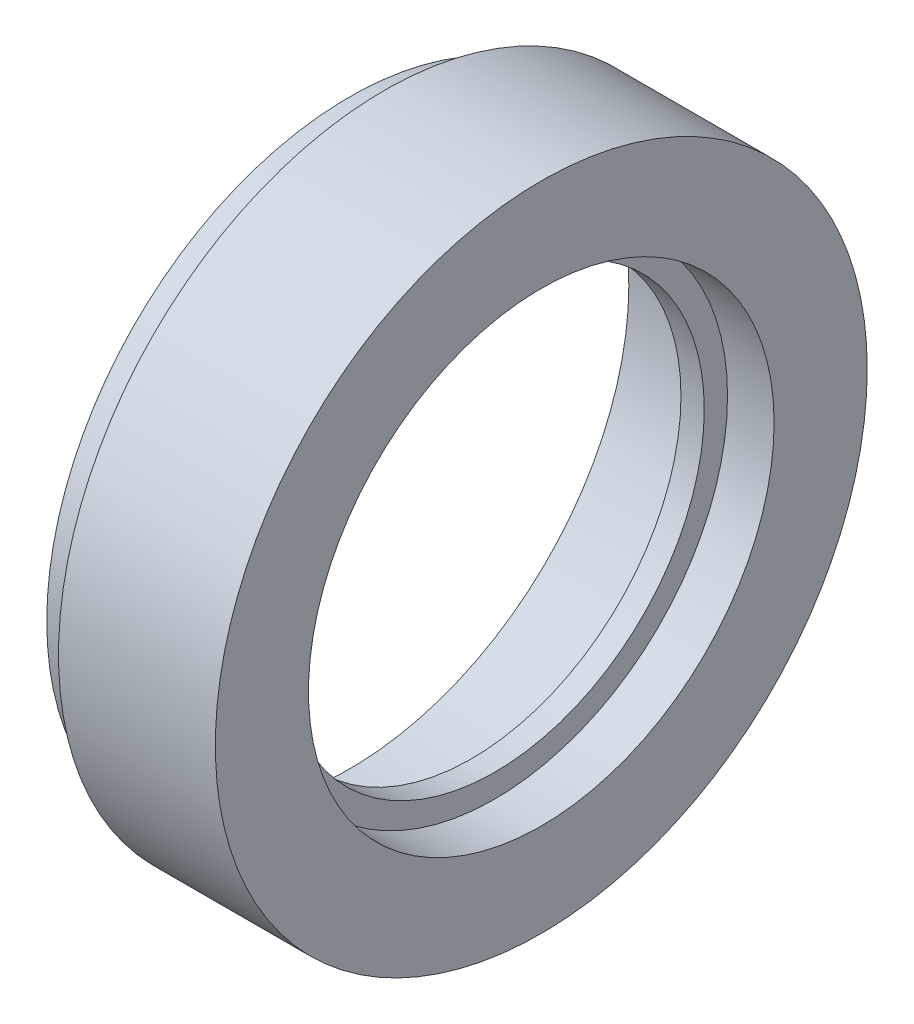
ISO-10303-21;
HEADER;
FILE_DESCRIPTION(('STEP AP214'),'2;1');
FILE_NAME('part.step','',(''),(''),'','','');
FILE_SCHEMA(('AUTOMOTIVE_DESIGN { 1 0 10303 214 1 1 1 1 }'));
ENDSEC;
DATA;
#1=APPLICATION_CONTEXT('core data for automotive mechanical design processes');
#2=APPLICATION_PROTOCOL_DEFINITION('international standard','automotive_design',2000,#1);
#3=PRODUCT_CONTEXT('',#1,'mechanical');
#4=PRODUCT('Part','Part','',(#3));
#5=PRODUCT_RELATED_PRODUCT_CATEGORY('part','',(#4));
#6=PRODUCT_DEFINITION_FORMATION('','',#4);
#7=PRODUCT_DEFINITION_CONTEXT('part definition',#1,'design');
#8=PRODUCT_DEFINITION('design','',#6,#7);
#9=PRODUCT_DEFINITION_SHAPE('','',#8);
#10=(LENGTH_UNIT() NAMED_UNIT(*) SI_UNIT(.MILLI.,.METRE.));
#11=(NAMED_UNIT(*) PLANE_ANGLE_UNIT() SI_UNIT($,.RADIAN.));
#12=(NAMED_UNIT(*) SI_UNIT($,.STERADIAN.) SOLID_ANGLE_UNIT());
#13=UNCERTAINTY_MEASURE_WITH_UNIT(LENGTH_MEASURE(1.E-05),#10,'distance_accuracy_value','');
#14=(GEOMETRIC_REPRESENTATION_CONTEXT(3) GLOBAL_UNCERTAINTY_ASSIGNED_CONTEXT((#13)) GLOBAL_UNIT_ASSIGNED_CONTEXT((#10,
#11,#12)) REPRESENTATION_CONTEXT('',''));
#15=CARTESIAN_POINT('',(0.,0.,0.));
#16=DIRECTION('',(0.,0.,1.));
#17=DIRECTION('',(1.,0.,0.));
#18=AXIS2_PLACEMENT_3D('',#15,#16,#17);
#19=CARTESIAN_POINT('',(0.,0.,0.));
#20=DIRECTION('',(1.,0.,0.));
#21=DIRECTION('',(0.,0.,-1.));
#22=AXIS2_PLACEMENT_3D('',#19,#20,#21);
#23=CYLINDRICAL_SURFACE('',#22,41.275);
#24=CARTESIAN_POINT('',(0.,0.,0.));
#25=DIRECTION('',(1.,0.,0.));
#26=DIRECTION('',(0.,0.,-1.));
#27=AXIS2_PLACEMENT_3D('',#24,#25,#26);
#28=CIRCLE('',#27,41.275);
#29=CARTESIAN_POINT('',(0.,0.,-41.275));
#30=VERTEX_POINT('',#29);
#31=EDGE_CURVE('E65',#30,#30,#28,.T.);
#32=ORIENTED_EDGE('',*,*,#31,.T.);
#33=EDGE_LOOP('',(#32));
#34=FACE_BOUND('',#33,.T.);
#35=CARTESIAN_POINT('',(4.77520000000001,0.,0.));
#36=DIRECTION('',(1.,0.,0.));
#37=DIRECTION('',(0.,0.,-1.));
#38=AXIS2_PLACEMENT_3D('',#35,#36,#37);
#39=CIRCLE('',#38,41.275);
#40=CARTESIAN_POINT('',(4.77520000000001,0.,-41.275));
#41=VERTEX_POINT('',#40);
#42=EDGE_CURVE('E10',#41,#41,#39,.T.);
#43=ORIENTED_EDGE('',*,*,#42,.F.);
#44=EDGE_LOOP('',(#43));
#45=FACE_BOUND('',#44,.T.);
#46=ADVANCED_FACE('F31',(#34,#45),#23,.T.);
#47=CARTESIAN_POINT('',(4.77520000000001,44.45,0.));
#48=DIRECTION('',(-1.,0.,0.));
#49=DIRECTION('',(0.,0.,1.));
#50=AXIS2_PLACEMENT_3D('',#47,#48,#49);
#51=PLANE('',#50);
#52=ORIENTED_EDGE('',*,*,#42,.T.);
#53=EDGE_LOOP('',(#52));
#54=FACE_BOUND('',#53,.T.);
#55=CARTESIAN_POINT('',(4.77520000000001,0.,0.));
#56=DIRECTION('',(1.,0.,0.));
#57=DIRECTION('',(0.,0.,-1.));
#58=AXIS2_PLACEMENT_3D('',#55,#56,#57);
#59=CIRCLE('',#58,44.45);
#60=CARTESIAN_POINT('',(4.77520000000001,0.,-44.45));
#61=VERTEX_POINT('',#60);
#62=EDGE_CURVE('E37',#61,#61,#59,.T.);
#63=ORIENTED_EDGE('',*,*,#62,.F.);
#64=EDGE_LOOP('',(#63));
#65=FACE_BOUND('',#64,.T.);
#66=ADVANCED_FACE('F83',(#54,#65),#51,.T.);
#67=CARTESIAN_POINT('',(0.,0.,0.));
#68=DIRECTION('',(1.,0.,0.));
#69=DIRECTION('',(0.,0.,-1.));
#70=AXIS2_PLACEMENT_3D('',#67,#68,#69);
#71=CYLINDRICAL_SURFACE('',#70,44.45);
#72=ORIENTED_EDGE('',*,*,#62,.T.);
#73=EDGE_LOOP('',(#72));
#74=FACE_BOUND('',#73,.T.);
#75=CARTESIAN_POINT('',(26.162,0.,0.));
#76=DIRECTION('',(1.,0.,0.));
#77=DIRECTION('',(0.,0.,-1.));
#78=AXIS2_PLACEMENT_3D('',#75,#76,#77);
#79=CIRCLE('',#78,44.45);
#80=CARTESIAN_POINT('',(26.162,0.,-44.45));
#81=VERTEX_POINT('',#80);
#82=EDGE_CURVE('E41',#81,#81,#79,.T.);
#83=ORIENTED_EDGE('',*,*,#82,.F.);
#84=EDGE_LOOP('',(#83));
#85=FACE_BOUND('',#84,.T.);
#86=ADVANCED_FACE('F87',(#74,#85),#71,.T.);
#87=CARTESIAN_POINT('',(26.162,31.75,0.));
#88=DIRECTION('',(1.,0.,0.));
#89=DIRECTION('',(0.,0.,-1.));
#90=AXIS2_PLACEMENT_3D('',#87,#88,#89);
#91=PLANE('',#90);
#92=ORIENTED_EDGE('',*,*,#82,.T.);
#93=EDGE_LOOP('',(#92));
#94=FACE_BOUND('',#93,.T.);
#95=CARTESIAN_POINT('',(26.162,0.,0.));
#96=DIRECTION('',(1.,0.,0.));
#97=DIRECTION('',(0.,0.,-1.));
#98=AXIS2_PLACEMENT_3D('',#95,#96,#97);
#99=CIRCLE('',#98,31.75);
#100=CARTESIAN_POINT('',(26.162,0.,-31.75));
#101=VERTEX_POINT('',#100);
#102=EDGE_CURVE('E45',#101,#101,#99,.T.);
#103=ORIENTED_EDGE('',*,*,#102,.F.);
#104=EDGE_LOOP('',(#103));
#105=FACE_BOUND('',#104,.T.);
#106=ADVANCED_FACE('F91',(#94,#105),#91,.T.);
#107=CARTESIAN_POINT('',(0.,0.,0.));
#108=DIRECTION('',(1.,0.,0.));
#109=DIRECTION('',(0.,0.,-1.));
#110=AXIS2_PLACEMENT_3D('',#107,#108,#109);
#111=CYLINDRICAL_SURFACE('',#110,31.75);
#112=ORIENTED_EDGE('',*,*,#102,.T.);
#113=EDGE_LOOP('',(#112));
#114=FACE_BOUND('',#113,.T.);
#115=CARTESIAN_POINT('',(19.812,0.,0.));
#116=DIRECTION('',(1.,0.,0.));
#117=DIRECTION('',(0.,0.,-1.));
#118=AXIS2_PLACEMENT_3D('',#115,#116,#117);
#119=CIRCLE('',#118,31.75);
#120=CARTESIAN_POINT('',(19.812,0.,-31.75));
#121=VERTEX_POINT('',#120);
#122=EDGE_CURVE('E50',#121,#121,#119,.T.);
#123=ORIENTED_EDGE('',*,*,#122,.F.);
#124=EDGE_LOOP('',(#123));
#125=FACE_BOUND('',#124,.T.);
#126=ADVANCED_FACE('F97',(#114,#125),#111,.F.);
#127=CARTESIAN_POINT('',(19.812,28.575,0.));
#128=DIRECTION('',(1.,0.,0.));
#129=DIRECTION('',(0.,0.,-1.));
#130=AXIS2_PLACEMENT_3D('',#127,#128,#129);
#131=PLANE('',#130);
#132=ORIENTED_EDGE('',*,*,#122,.T.);
#133=EDGE_LOOP('',(#132));
#134=FACE_BOUND('',#133,.T.);
#135=CARTESIAN_POINT('',(19.812,0.,0.));
#136=DIRECTION('',(1.,0.,0.));
#137=DIRECTION('',(0.,0.,-1.));
#138=AXIS2_PLACEMENT_3D('',#135,#136,#137);
#139=CIRCLE('',#138,28.575);
#140=CARTESIAN_POINT('',(19.812,0.,-28.575));
#141=VERTEX_POINT('',#140);
#142=EDGE_CURVE('E53',#141,#141,#139,.T.);
#143=ORIENTED_EDGE('',*,*,#142,.F.);
#144=EDGE_LOOP('',(#143));
#145=FACE_BOUND('',#144,.T.);
#146=ADVANCED_FACE('F101',(#134,#145),#131,.T.);
#147=CARTESIAN_POINT('',(0.,0.,0.));
#148=DIRECTION('',(1.,0.,0.));
#149=DIRECTION('',(0.,0.,-1.));
#150=AXIS2_PLACEMENT_3D('',#147,#148,#149);
#151=CYLINDRICAL_SURFACE('',#150,28.575);
#152=ORIENTED_EDGE('',*,*,#142,.T.);
#153=EDGE_LOOP('',(#152));
#154=FACE_BOUND('',#153,.T.);
#155=CARTESIAN_POINT('',(16.637,0.,0.));
#156=DIRECTION('',(1.,0.,0.));
#157=DIRECTION('',(0.,0.,-1.));
#158=AXIS2_PLACEMENT_3D('',#155,#156,#157);
#159=CIRCLE('',#158,28.575);
#160=CARTESIAN_POINT('',(16.637,0.,-28.575));
#161=VERTEX_POINT('',#160);
#162=EDGE_CURVE('E56',#161,#161,#159,.T.);
#163=ORIENTED_EDGE('',*,*,#162,.F.);
#164=EDGE_LOOP('',(#163));
#165=FACE_BOUND('',#164,.T.);
#166=ADVANCED_FACE('F105',(#154,#165),#151,.F.);
#167=CARTESIAN_POINT('',(16.637,38.1,0.));
#168=DIRECTION('',(-1.,0.,0.));
#169=DIRECTION('',(0.,0.,1.));
#170=AXIS2_PLACEMENT_3D('',#167,#168,#169);
#171=PLANE('',#170);
#172=ORIENTED_EDGE('',*,*,#162,.T.);
#173=EDGE_LOOP('',(#172));
#174=FACE_BOUND('',#173,.T.);
#175=CARTESIAN_POINT('',(16.637,0.,0.));
#176=DIRECTION('',(1.,0.,0.));
#177=DIRECTION('',(0.,0.,-1.));
#178=AXIS2_PLACEMENT_3D('',#175,#176,#177);
#179=CIRCLE('',#178,38.1);
#180=CARTESIAN_POINT('',(16.637,0.,-38.1));
#181=VERTEX_POINT('',#180);
#182=EDGE_CURVE('E59',#181,#181,#179,.T.);
#183=ORIENTED_EDGE('',*,*,#182,.F.);
#184=EDGE_LOOP('',(#183));
#185=FACE_BOUND('',#184,.T.);
#186=ADVANCED_FACE('F79',(#174,#185),#171,.T.);
#187=CARTESIAN_POINT('',(0.,0.,0.));
#188=DIRECTION('',(1.,0.,0.));
#189=DIRECTION('',(0.,0.,-1.));
#190=AXIS2_PLACEMENT_3D('',#187,#188,#189);
#191=CYLINDRICAL_SURFACE('',#190,38.1);
#192=ORIENTED_EDGE('',*,*,#182,.T.);
#193=EDGE_LOOP('',(#192));
#194=FACE_BOUND('',#193,.T.);
#195=CARTESIAN_POINT('',(0.,0.,0.));
#196=DIRECTION('',(1.,0.,0.));
#197=DIRECTION('',(0.,0.,-1.));
#198=AXIS2_PLACEMENT_3D('',#195,#196,#197);
#199=CIRCLE('',#198,38.1);
#200=CARTESIAN_POINT('',(0.,0.,-38.1));
#201=VERTEX_POINT('',#200);
#202=EDGE_CURVE('E62',#201,#201,#199,.T.);
#203=ORIENTED_EDGE('',*,*,#202,.F.);
#204=EDGE_LOOP('',(#203));
#205=FACE_BOUND('',#204,.T.);
#206=ADVANCED_FACE('F73',(#194,#205),#191,.F.);
#207=CARTESIAN_POINT('',(0.,41.275,0.));
#208=DIRECTION('',(-1.,0.,0.));
#209=DIRECTION('',(0.,0.,1.));
#210=AXIS2_PLACEMENT_3D('',#207,#208,#209);
#211=PLANE('',#210);
#212=ORIENTED_EDGE('',*,*,#202,.T.);
#213=EDGE_LOOP('',(#212));
#214=FACE_BOUND('',#213,.T.);
#215=ORIENTED_EDGE('',*,*,#31,.F.);
#216=EDGE_LOOP('',(#215));
#217=FACE_BOUND('',#216,.T.);
#218=ADVANCED_FACE('F71',(#214,#217),#211,.T.);
#219=CLOSED_SHELL('',(#46,#66,#86,#106,#126,#146,#166,#186,#206,#218));
#220=MANIFOLD_SOLID_BREP('B2',#219);
#221=ADVANCED_BREP_SHAPE_REPRESENTATION('',(#18,#220),#14);
#222=SHAPE_DEFINITION_REPRESENTATION(#9,#221);
ENDSEC;
END-ISO-10303-21;
